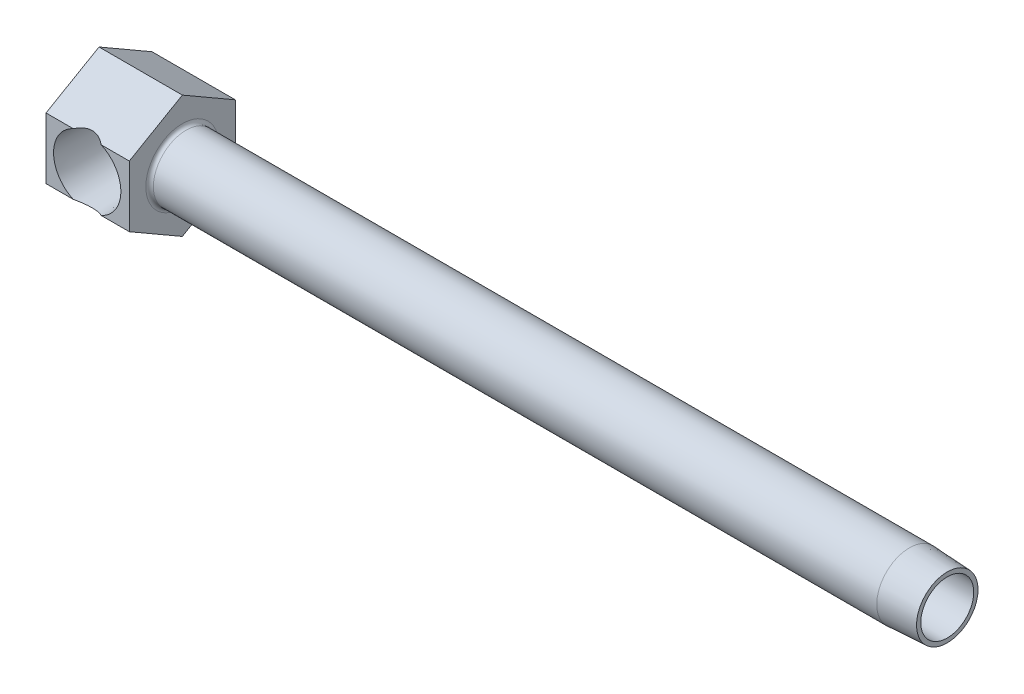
ISO-10303-21;
HEADER;
FILE_DESCRIPTION(('STEP AP214'),'2;1');
FILE_NAME('part.step','',(''),(''),'','','');
FILE_SCHEMA(('AUTOMOTIVE_DESIGN { 1 0 10303 214 1 1 1 1 }'));
ENDSEC;
DATA;
#1=APPLICATION_CONTEXT('core data for automotive mechanical design processes');
#2=APPLICATION_PROTOCOL_DEFINITION('international standard','automotive_design',2000,#1);
#3=PRODUCT_CONTEXT('',#1,'mechanical');
#4=PRODUCT('Part','Part','',(#3));
#5=PRODUCT_RELATED_PRODUCT_CATEGORY('part','',(#4));
#6=PRODUCT_DEFINITION_FORMATION('','',#4);
#7=PRODUCT_DEFINITION_CONTEXT('part definition',#1,'design');
#8=PRODUCT_DEFINITION('design','',#6,#7);
#9=PRODUCT_DEFINITION_SHAPE('','',#8);
#10=(LENGTH_UNIT() NAMED_UNIT(*) SI_UNIT(.MILLI.,.METRE.));
#11=(NAMED_UNIT(*) PLANE_ANGLE_UNIT() SI_UNIT($,.RADIAN.));
#12=(NAMED_UNIT(*) SI_UNIT($,.STERADIAN.) SOLID_ANGLE_UNIT());
#13=UNCERTAINTY_MEASURE_WITH_UNIT(LENGTH_MEASURE(1.E-05),#10,'distance_accuracy_value','');
#14=(GEOMETRIC_REPRESENTATION_CONTEXT(3) GLOBAL_UNCERTAINTY_ASSIGNED_CONTEXT((#13)) GLOBAL_UNIT_ASSIGNED_CONTEXT((#10,
#11,#12)) REPRESENTATION_CONTEXT('',''));
#15=CARTESIAN_POINT('',(0.,0.,0.));
#16=DIRECTION('',(0.,0.,1.));
#17=DIRECTION('',(1.,0.,0.));
#18=AXIS2_PLACEMENT_3D('',#15,#16,#17);
#19=CARTESIAN_POINT('',(63.5,0.,11.1125));
#20=DIRECTION('',(-1.,0.,0.));
#21=DIRECTION('',(0.,0.,1.));
#22=AXIS2_PLACEMENT_3D('',#19,#20,#21);
#23=CYLINDRICAL_SURFACE('',#22,6.858);
#24=CARTESIAN_POINT('',(18.2499,0.,11.1125));
#25=DIRECTION('',(-1.,0.,0.));
#26=DIRECTION('',(0.,-1.,0.));
#27=AXIS2_PLACEMENT_3D('',#24,#25,#26);
#28=CIRCLE('',#27,6.858);
#29=CARTESIAN_POINT('',(18.2499,-6.858,11.1125));
#30=VERTEX_POINT('',#29);
#31=EDGE_CURVE('E174',#30,#30,#28,.F.);
#32=ORIENTED_EDGE('',*,*,#31,.T.);
#33=EDGE_LOOP('',(#32));
#34=FACE_BOUND('',#33,.T.);
#35=CARTESIAN_POINT('',(169.8752,0.,11.1125));
#36=DIRECTION('',(1.,0.,0.));
#37=DIRECTION('',(0.,0.,-1.));
#38=AXIS2_PLACEMENT_3D('',#35,#36,#37);
#39=CIRCLE('',#38,6.858);
#40=CARTESIAN_POINT('',(169.8752,0.,4.2545));
#41=VERTEX_POINT('',#40);
#42=EDGE_CURVE('E218',#41,#41,#39,.T.);
#43=ORIENTED_EDGE('',*,*,#42,.F.);
#44=EDGE_LOOP('',(#43));
#45=FACE_BOUND('',#44,.T.);
#46=ADVANCED_FACE('F15',(#34,#45),#23,.T.);
#47=CARTESIAN_POINT('',(17.4625,6.4158048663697,22.225));
#48=DIRECTION('',(0.,0.,-1.));
#49=DIRECTION('',(0.,1.,0.));
#50=AXIS2_PLACEMENT_3D('',#47,#48,#49);
#51=PLANE('',#50);
#52=CARTESIAN_POINT('',(8.636,0.,22.225));
#53=DIRECTION('',(0.,0.,1.));
#54=DIRECTION('',(1.,0.,0.));
#55=AXIS2_PLACEMENT_3D('',#52,#53,#54);
#56=CIRCLE('',#55,7.05231);
#57=CARTESIAN_POINT('',(5.70811266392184,6.4158048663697,22.225));
#58=VERTEX_POINT('',#57);
#59=CARTESIAN_POINT('',(5.70811266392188,-6.41580486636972,22.225));
#60=VERTEX_POINT('',#59);
#61=EDGE_CURVE('E229',#58,#60,#56,.T.);
#62=ORIENTED_EDGE('',*,*,#61,.F.);
#63=DIRECTION('',(-1.,0.,0.));
#64=VECTOR('',#63,1.);
#65=CARTESIAN_POINT('',(17.4625,6.4158048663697,22.225));
#66=LINE('',#65,#64);
#67=CARTESIAN_POINT('',(0.,6.4158048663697,22.225));
#68=VERTEX_POINT('',#67);
#69=EDGE_CURVE('E158',#58,#68,#66,.T.);
#70=ORIENTED_EDGE('',*,*,#69,.T.);
#71=DIRECTION('',(0.,-1.,0.));
#72=VECTOR('',#71,1.);
#73=CARTESIAN_POINT('',(0.,6.4158048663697,22.225));
#74=LINE('',#73,#72);
#75=CARTESIAN_POINT('',(0.,-6.41580486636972,22.225));
#76=VERTEX_POINT('',#75);
#77=EDGE_CURVE('E128',#68,#76,#74,.T.);
#78=ORIENTED_EDGE('',*,*,#77,.T.);
#79=DIRECTION('',(-1.,0.,0.));
#80=VECTOR('',#79,1.);
#81=CARTESIAN_POINT('',(17.4625,-6.41580486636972,22.225));
#82=LINE('',#81,#80);
#83=EDGE_CURVE('E154',#60,#76,#82,.T.);
#84=ORIENTED_EDGE('',*,*,#83,.F.);
#85=EDGE_LOOP('',(#62,#70,#78,#84));
#86=FACE_BOUND('',#85,.T.);
#87=ADVANCED_FACE('F205',(#86),#51,.F.);
#88=CARTESIAN_POINT('',(11.5638873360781,-6.41580486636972,22.225));
#89=VERTEX_POINT('',#88);
#90=CARTESIAN_POINT('',(11.5638873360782,6.4158048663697,22.225));
#91=VERTEX_POINT('',#90);
#92=EDGE_CURVE('E228',#89,#91,#56,.T.);
#93=ORIENTED_EDGE('',*,*,#92,.F.);
#94=CARTESIAN_POINT('',(17.4625,-6.41580486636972,22.225));
#95=VERTEX_POINT('',#94);
#96=EDGE_CURVE('E155',#95,#89,#82,.T.);
#97=ORIENTED_EDGE('',*,*,#96,.F.);
#98=DIRECTION('',(0.,-1.,0.));
#99=VECTOR('',#98,1.);
#100=CARTESIAN_POINT('',(17.4625,6.4158048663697,22.225));
#101=LINE('',#100,#99);
#102=CARTESIAN_POINT('',(17.4625,6.4158048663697,22.225));
#103=VERTEX_POINT('',#102);
#104=EDGE_CURVE('E145',#103,#95,#101,.T.);
#105=ORIENTED_EDGE('',*,*,#104,.F.);
#106=EDGE_CURVE('E159',#103,#91,#66,.T.);
#107=ORIENTED_EDGE('',*,*,#106,.T.);
#108=EDGE_LOOP('',(#93,#97,#105,#107));
#109=FACE_BOUND('',#108,.T.);
#110=ADVANCED_FACE('F211',(#109),#51,.F.);
#111=CARTESIAN_POINT('',(17.4625,12.8316097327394,11.1125));
#112=DIRECTION('',(0.,-0.866025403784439,-0.5));
#113=DIRECTION('',(0.,0.5,-0.866025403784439));
#114=AXIS2_PLACEMENT_3D('',#111,#112,#113);
#115=PLANE('',#114);
#116=ORIENTED_EDGE('',*,*,#69,.F.);
#117=CARTESIAN_POINT('',(8.636,-0.384020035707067,34.002642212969));
#118=DIRECTION('',(0.,-0.866025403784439,-0.5));
#119=DIRECTION('',(0.,-0.5,0.866025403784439));
#120=AXIS2_PLACEMENT_3D('',#117,#118,#119);
#121=ELLIPSE('',#120,14.8098967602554,7.39498405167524);
#122=EDGE_CURVE('E109',#58,#91,#121,.T.);
#123=ORIENTED_EDGE('',*,*,#122,.T.);
#124=ORIENTED_EDGE('',*,*,#106,.F.);
#125=DIRECTION('',(0.,-0.5,0.866025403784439));
#126=VECTOR('',#125,1.);
#127=CARTESIAN_POINT('',(17.4625,12.8316097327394,11.1125));
#128=LINE('',#127,#126);
#129=CARTESIAN_POINT('',(17.4625,12.8316097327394,11.1125));
#130=VERTEX_POINT('',#129);
#131=EDGE_CURVE('E143',#130,#103,#128,.T.);
#132=ORIENTED_EDGE('',*,*,#131,.F.);
#133=DIRECTION('',(-1.,0.,0.));
#134=VECTOR('',#133,1.);
#135=CARTESIAN_POINT('',(17.4625,12.8316097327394,11.1125));
#136=LINE('',#135,#134);
#137=CARTESIAN_POINT('',(0.,12.8316097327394,11.1125));
#138=VERTEX_POINT('',#137);
#139=EDGE_CURVE('E162',#130,#138,#136,.T.);
#140=ORIENTED_EDGE('',*,*,#139,.T.);
#141=DIRECTION('',(0.,-0.5,0.866025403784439));
#142=VECTOR('',#141,1.);
#143=CARTESIAN_POINT('',(0.,12.8316097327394,11.1125));
#144=LINE('',#143,#142);
#145=EDGE_CURVE('E124',#138,#68,#144,.T.);
#146=ORIENTED_EDGE('',*,*,#145,.T.);
#147=EDGE_LOOP('',(#116,#123,#124,#132,#140,#146));
#148=FACE_BOUND('',#147,.T.);
#149=ADVANCED_FACE('F257',(#148),#115,.F.);
#150=CARTESIAN_POINT('',(17.4625,-6.41580486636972,22.225));
#151=DIRECTION('',(0.,0.866025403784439,-0.5));
#152=DIRECTION('',(0.,0.5,0.866025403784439));
#153=AXIS2_PLACEMENT_3D('',#150,#151,#152);
#154=PLANE('',#153);
#155=ORIENTED_EDGE('',*,*,#96,.T.);
#156=CARTESIAN_POINT('',(8.636,0.384020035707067,34.0026422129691));
#157=DIRECTION('',(0.,0.866025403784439,-0.5));
#158=DIRECTION('',(0.,0.5,0.866025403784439));
#159=AXIS2_PLACEMENT_3D('',#156,#157,#158);
#160=ELLIPSE('',#159,14.8098967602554,7.39498405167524);
#161=EDGE_CURVE('E34',#89,#60,#160,.T.);
#162=ORIENTED_EDGE('',*,*,#161,.T.);
#163=ORIENTED_EDGE('',*,*,#83,.T.);
#164=DIRECTION('',(0.,-0.5,-0.866025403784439));
#165=VECTOR('',#164,1.);
#166=CARTESIAN_POINT('',(0.,-6.41580486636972,22.225));
#167=LINE('',#166,#165);
#168=CARTESIAN_POINT('',(0.,-12.8316097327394,11.1125));
#169=VERTEX_POINT('',#168);
#170=EDGE_CURVE('E132',#76,#169,#167,.T.);
#171=ORIENTED_EDGE('',*,*,#170,.T.);
#172=DIRECTION('',(-1.,0.,0.));
#173=VECTOR('',#172,1.);
#174=CARTESIAN_POINT('',(17.4625,-12.8316097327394,11.1125));
#175=LINE('',#174,#173);
#176=CARTESIAN_POINT('',(17.4625,-12.8316097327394,11.1125));
#177=VERTEX_POINT('',#176);
#178=EDGE_CURVE('E149',#177,#169,#175,.T.);
#179=ORIENTED_EDGE('',*,*,#178,.F.);
#180=DIRECTION('',(0.,-0.5,-0.866025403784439));
#181=VECTOR('',#180,1.);
#182=CARTESIAN_POINT('',(17.4625,-6.41580486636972,22.225));
#183=LINE('',#182,#181);
#184=EDGE_CURVE('E147',#95,#177,#183,.T.);
#185=ORIENTED_EDGE('',*,*,#184,.F.);
#186=EDGE_LOOP('',(#155,#162,#163,#171,#179,#185));
#187=FACE_BOUND('',#186,.T.);
#188=ADVANCED_FACE('F235',(#187),#154,.F.);
#189=CARTESIAN_POINT('',(17.4625,-12.8316097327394,11.1125));
#190=DIRECTION('',(0.,0.866025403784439,0.5));
#191=DIRECTION('',(0.,-0.5,0.866025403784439));
#192=AXIS2_PLACEMENT_3D('',#189,#190,#191);
#193=PLANE('',#192);
#194=DIRECTION('',(0.,0.5,-0.866025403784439));
#195=VECTOR('',#194,1.);
#196=CARTESIAN_POINT('',(0.,-12.8316097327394,11.1125));
#197=LINE('',#196,#195);
#198=CARTESIAN_POINT('',(0.,-6.41580486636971,0.));
#199=VERTEX_POINT('',#198);
#200=EDGE_CURVE('E117',#169,#199,#197,.T.);
#201=ORIENTED_EDGE('',*,*,#200,.T.);
#202=DIRECTION('',(-1.,0.,0.));
#203=VECTOR('',#202,1.);
#204=CARTESIAN_POINT('',(17.4625,-6.41580486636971,0.));
#205=LINE('',#204,#203);
#206=CARTESIAN_POINT('',(17.4625,-6.41580486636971,0.));
#207=VERTEX_POINT('',#206);
#208=EDGE_CURVE('E168',#207,#199,#205,.T.);
#209=ORIENTED_EDGE('',*,*,#208,.F.);
#210=DIRECTION('',(0.,0.5,-0.866025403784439));
#211=VECTOR('',#210,1.);
#212=CARTESIAN_POINT('',(17.4625,-12.8316097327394,11.1125));
#213=LINE('',#212,#211);
#214=EDGE_CURVE('E135',#177,#207,#213,.T.);
#215=ORIENTED_EDGE('',*,*,#214,.F.);
#216=ORIENTED_EDGE('',*,*,#178,.T.);
#217=EDGE_LOOP('',(#201,#209,#215,#216));
#218=FACE_BOUND('',#217,.T.);
#219=ADVANCED_FACE('F247',(#218),#193,.F.);
#220=CARTESIAN_POINT('',(17.4625,-6.41580486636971,0.));
#221=DIRECTION('',(0.,0.,1.));
#222=DIRECTION('',(1.,0.,0.));
#223=AXIS2_PLACEMENT_3D('',#220,#221,#222);
#224=PLANE('',#223);
#225=DIRECTION('',(0.,1.,0.));
#226=VECTOR('',#225,1.);
#227=CARTESIAN_POINT('',(0.,-6.41580486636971,0.));
#228=LINE('',#227,#226);
#229=CARTESIAN_POINT('',(0.,6.41580486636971,0.));
#230=VERTEX_POINT('',#229);
#231=EDGE_CURVE('E118',#199,#230,#228,.T.);
#232=ORIENTED_EDGE('',*,*,#231,.T.);
#233=DIRECTION('',(-1.,0.,0.));
#234=VECTOR('',#233,1.);
#235=CARTESIAN_POINT('',(17.4625,6.41580486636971,0.));
#236=LINE('',#235,#234);
#237=CARTESIAN_POINT('',(17.4625,6.41580486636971,0.));
#238=VERTEX_POINT('',#237);
#239=EDGE_CURVE('E165',#238,#230,#236,.T.);
#240=ORIENTED_EDGE('',*,*,#239,.F.);
#241=DIRECTION('',(0.,1.,0.));
#242=VECTOR('',#241,1.);
#243=CARTESIAN_POINT('',(17.4625,-6.41580486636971,0.));
#244=LINE('',#243,#242);
#245=EDGE_CURVE('E139',#207,#238,#244,.T.);
#246=ORIENTED_EDGE('',*,*,#245,.F.);
#247=ORIENTED_EDGE('',*,*,#208,.T.);
#248=EDGE_LOOP('',(#232,#240,#246,#247));
#249=FACE_BOUND('',#248,.T.);
#250=ADVANCED_FACE('F264',(#249),#224,.F.);
#251=CARTESIAN_POINT('',(17.4625,6.4158048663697,0.));
#252=DIRECTION('',(0.,-0.866025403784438,0.5));
#253=DIRECTION('',(0.,-0.5,-0.866025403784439));
#254=AXIS2_PLACEMENT_3D('',#251,#252,#253);
#255=PLANE('',#254);
#256=DIRECTION('',(0.,0.5,0.866025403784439));
#257=VECTOR('',#256,1.);
#258=CARTESIAN_POINT('',(0.,6.4158048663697,0.));
#259=LINE('',#258,#257);
#260=EDGE_CURVE('E121',#230,#138,#259,.T.);
#261=ORIENTED_EDGE('',*,*,#260,.T.);
#262=ORIENTED_EDGE('',*,*,#139,.F.);
#263=DIRECTION('',(0.,0.5,0.866025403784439));
#264=VECTOR('',#263,1.);
#265=CARTESIAN_POINT('',(17.4625,6.4158048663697,0.));
#266=LINE('',#265,#264);
#267=EDGE_CURVE('E141',#238,#130,#266,.T.);
#268=ORIENTED_EDGE('',*,*,#267,.F.);
#269=ORIENTED_EDGE('',*,*,#239,.T.);
#270=EDGE_LOOP('',(#261,#262,#268,#269));
#271=FACE_BOUND('',#270,.T.);
#272=ADVANCED_FACE('F261',(#271),#255,.F.);
#273=CARTESIAN_POINT('',(17.4625,-19.2474145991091,22.225));
#274=DIRECTION('',(-1.,0.,0.));
#275=DIRECTION('',(0.,-1.,0.));
#276=AXIS2_PLACEMENT_3D('',#273,#274,#275);
#277=PLANE('',#276);
#278=CARTESIAN_POINT('',(17.4625,0.,11.1125));
#279=DIRECTION('',(-1.,0.,0.));
#280=DIRECTION('',(0.,-1.,0.));
#281=AXIS2_PLACEMENT_3D('',#278,#279,#280);
#282=CIRCLE('',#281,7.6454);
#283=CARTESIAN_POINT('',(17.4625,-7.6454,11.1125));
#284=VERTEX_POINT('',#283);
#285=EDGE_CURVE('E171',#284,#284,#282,.T.);
#286=ORIENTED_EDGE('',*,*,#285,.T.);
#287=EDGE_LOOP('',(#286));
#288=FACE_BOUND('',#287,.T.);
#289=ORIENTED_EDGE('',*,*,#214,.T.);
#290=ORIENTED_EDGE('',*,*,#245,.T.);
#291=ORIENTED_EDGE('',*,*,#267,.T.);
#292=ORIENTED_EDGE('',*,*,#131,.T.);
#293=ORIENTED_EDGE('',*,*,#104,.T.);
#294=ORIENTED_EDGE('',*,*,#184,.T.);
#295=EDGE_LOOP('',(#289,#290,#291,#292,#293,#294));
#296=FACE_BOUND('',#295,.T.);
#297=ADVANCED_FACE('F250',(#288,#296),#277,.F.);
#298=CARTESIAN_POINT('',(0.,-19.2474145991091,22.225));
#299=DIRECTION('',(-1.,0.,0.));
#300=DIRECTION('',(0.,-1.,0.));
#301=AXIS2_PLACEMENT_3D('',#298,#299,#300);
#302=PLANE('',#301);
#303=ORIENTED_EDGE('',*,*,#200,.F.);
#304=ORIENTED_EDGE('',*,*,#170,.F.);
#305=ORIENTED_EDGE('',*,*,#77,.F.);
#306=ORIENTED_EDGE('',*,*,#145,.F.);
#307=ORIENTED_EDGE('',*,*,#260,.F.);
#308=ORIENTED_EDGE('',*,*,#231,.F.);
#309=EDGE_LOOP('',(#303,#304,#305,#306,#307,#308));
#310=FACE_BOUND('',#309,.T.);
#311=ADVANCED_FACE('F243',(#310),#302,.T.);
#312=CARTESIAN_POINT('',(18.2499,0.,11.1125));
#313=DIRECTION('',(-1.,0.,0.));
#314=DIRECTION('',(0.,-1.,0.));
#315=AXIS2_PLACEMENT_3D('',#312,#313,#314);
#316=TOROIDAL_SURFACE('',#315,7.6454,0.7874);
#317=ORIENTED_EDGE('',*,*,#31,.F.);
#318=EDGE_LOOP('',(#317));
#319=FACE_BOUND('',#318,.T.);
#320=ORIENTED_EDGE('',*,*,#285,.F.);
#321=EDGE_LOOP('',(#320));
#322=FACE_BOUND('',#321,.T.);
#323=ADVANCED_FACE('F282',(#319,#322),#316,.F.);
#324=CARTESIAN_POINT('',(63.5,0.,11.1125));
#325=DIRECTION('',(1.,0.,0.));
#326=DIRECTION('',(0.,0.,-1.));
#327=AXIS2_PLACEMENT_3D('',#324,#325,#326);
#328=CYLINDRICAL_SURFACE('',#327,5.5499);
#329=DIRECTION('',(1.,0.,0.));
#330=VECTOR('',#329,1.);
#331=CARTESIAN_POINT('',(63.5,1.29165930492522,5.715));
#332=LINE('',#331,#330);
#333=CARTESIAN_POINT('',(15.0655177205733,1.29165930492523,5.715));
#334=VERTEX_POINT('',#333);
#335=CARTESIAN_POINT('',(14.0465577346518,1.29165930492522,5.715));
#336=VERTEX_POINT('',#335);
#337=EDGE_CURVE('E27',#334,#336,#332,.F.);
#338=ORIENTED_EDGE('',*,*,#337,.T.);
#339=CARTESIAN_POINT('',(14.0465577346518,1.29165930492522,5.715));
#340=CARTESIAN_POINT('',(14.0725617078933,1.1828202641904,5.68893317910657));
#341=CARTESIAN_POINT('',(14.0954190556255,1.0724477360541,5.66602138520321));
#342=CARTESIAN_POINT('',(14.1345363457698,0.849345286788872,5.62681178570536));
#343=CARTESIAN_POINT('',(14.1507939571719,0.736614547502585,5.61051631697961));
#344=CARTESIAN_POINT('',(14.1760383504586,0.512691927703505,5.58521342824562));
#345=CARTESIAN_POINT('',(14.1852120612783,0.401542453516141,5.57601863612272));
#346=CARTESIAN_POINT('',(14.1968530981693,0.17856718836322,5.56435088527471));
#347=CARTESIAN_POINT('',(14.1993222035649,0.0667415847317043,5.56187614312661));
#348=CARTESIAN_POINT('',(14.1975723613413,-0.14949882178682,5.56362999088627));
#349=CARTESIAN_POINT('',(14.193779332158,-0.253921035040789,5.56743168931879));
#350=CARTESIAN_POINT('',(14.1803598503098,-0.462026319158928,5.58088200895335));
#351=CARTESIAN_POINT('',(14.1707325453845,-0.565709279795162,5.59053148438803));
#352=CARTESIAN_POINT('',(14.1454600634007,-0.774399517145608,5.61586264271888));
#353=CARTESIAN_POINT('',(14.12966315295,-0.87936981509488,5.63169642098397));
#354=CARTESIAN_POINT('',(14.092340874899,-1.08722287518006,5.6691068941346));
#355=CARTESIAN_POINT('',(14.0708169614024,-1.1901061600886,5.69068213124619));
#356=CARTESIAN_POINT('',(14.0465577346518,-1.29165930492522,5.715));
#357=B_SPLINE_CURVE_WITH_KNOTS('',3,(#339,#340,#341,#342,#343,#344,#345,#346,#347,#348,#349,
#350,#351,#352,#353,#354,#355,#356),.UNSPECIFIED.,.F.,.F.,(4,2,2,2,2,2,2,2,4),(0.,
0.344637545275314,0.689396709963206,1.02471413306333,1.35994255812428,1.67329546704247,
1.98669416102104,2.30834220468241,2.62990865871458),.UNSPECIFIED.);
#358=CARTESIAN_POINT('',(14.0465577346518,-1.29165930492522,5.715));
#359=VERTEX_POINT('',#358);
#360=EDGE_CURVE('E10',#336,#359,#357,.T.);
#361=ORIENTED_EDGE('',*,*,#360,.T.);
#362=DIRECTION('',(1.,0.,0.));
#363=VECTOR('',#362,1.);
#364=CARTESIAN_POINT('',(63.5,-1.29165930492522,5.715));
#365=LINE('',#364,#363);
#366=CARTESIAN_POINT('',(15.0655177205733,-1.29165930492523,5.715));
#367=VERTEX_POINT('',#366);
#368=EDGE_CURVE('E184',#359,#367,#365,.T.);
#369=ORIENTED_EDGE('',*,*,#368,.T.);
#370=CARTESIAN_POINT('',(15.0656795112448,-1.29082327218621,5.71480000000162));
#371=CARTESIAN_POINT('',(15.0372536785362,-1.43791824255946,5.7499521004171));
#372=CARTESIAN_POINT('',(15.0041876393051,-1.58262926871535,5.79093746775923));
#373=CARTESIAN_POINT('',(14.9298152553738,-1.86616189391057,5.88364074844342));
#374=CARTESIAN_POINT('',(14.8885204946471,-2.00499144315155,5.93534357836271));
#375=CARTESIAN_POINT('',(14.7990709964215,-2.27477346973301,6.0481148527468));
#376=CARTESIAN_POINT('',(14.7509848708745,-2.40578805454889,6.10909004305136));
#377=CARTESIAN_POINT('',(14.6486806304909,-2.66083130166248,6.2399326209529));
#378=CARTESIAN_POINT('',(14.5944604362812,-2.78485757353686,6.30980302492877));
#379=CARTESIAN_POINT('',(14.4812536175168,-3.02482355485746,6.4572285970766));
#380=CARTESIAN_POINT('',(14.4222960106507,-3.1408054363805,6.53473755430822));
#381=CARTESIAN_POINT('',(14.3003856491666,-3.365215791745,6.6970845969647));
#382=CARTESIAN_POINT('',(14.2374332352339,-3.47364490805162,6.78192205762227));
#383=CARTESIAN_POINT('',(14.0435453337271,-3.78827180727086,7.04729631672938));
#384=CARTESIAN_POINT('',(13.9079456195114,-3.9830565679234,7.23822682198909));
#385=CARTESIAN_POINT('',(13.689310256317,-4.26816238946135,7.56146618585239));
#386=CARTESIAN_POINT('',(13.6074310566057,-4.3686517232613,7.68585924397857));
#387=CARTESIAN_POINT('',(13.4442899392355,-4.55879004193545,7.94320688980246));
#388=CARTESIAN_POINT('',(13.3630282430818,-4.6484352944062,8.07616440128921));
#389=CARTESIAN_POINT('',(13.2036424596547,-4.81645966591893,8.35044586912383));
#390=CARTESIAN_POINT('',(13.1255135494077,-4.89485662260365,8.49175606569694));
#391=CARTESIAN_POINT('',(12.9752684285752,-5.04004510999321,8.78316437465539));
#392=CARTESIAN_POINT('',(12.9031480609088,-5.10684469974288,8.93325628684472));
#393=CARTESIAN_POINT('',(12.757824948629,-5.23785122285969,9.26762207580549));
#394=CARTESIAN_POINT('',(12.686320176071,-5.29990617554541,9.45350692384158));
#395=CARTESIAN_POINT('',(12.5645322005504,-5.40502712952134,9.83721903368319));
#396=CARTESIAN_POINT('',(12.5142004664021,-5.44813656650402,10.035017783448));
#397=CARTESIAN_POINT('',(12.4606756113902,-5.49679755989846,10.3395644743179));
#398=CARTESIAN_POINT('',(12.4464754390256,-5.51038902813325,10.443158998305));
#399=CARTESIAN_POINT('',(12.4264834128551,-5.5317354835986,10.6517762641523));
#400=CARTESIAN_POINT('',(12.4206908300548,-5.53949097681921,10.7567988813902));
#401=CARTESIAN_POINT('',(12.4179376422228,-5.54899639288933,10.9671942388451));
#402=CARTESIAN_POINT('',(12.4209736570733,-5.55074861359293,11.0725668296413));
#403=CARTESIAN_POINT('',(12.4357182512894,-5.54828805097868,11.2826067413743));
#404=CARTESIAN_POINT('',(12.4474268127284,-5.54407527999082,11.3872740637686));
#405=CARTESIAN_POINT('',(12.4900727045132,-5.52483789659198,11.6684350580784));
#406=CARTESIAN_POINT('',(12.5287513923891,-5.5042766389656,11.8434168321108));
#407=CARTESIAN_POINT('',(12.6245766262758,-5.44793106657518,12.1856637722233));
#408=CARTESIAN_POINT('',(12.6817493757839,-5.41212512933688,12.3529176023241));
#409=CARTESIAN_POINT('',(12.8020710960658,-5.33165221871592,12.6608364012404));
#410=CARTESIAN_POINT('',(12.8638814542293,-5.28838367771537,12.8024081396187));
#411=CARTESIAN_POINT('',(12.9946271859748,-5.19196308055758,13.0788046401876));
#412=CARTESIAN_POINT('',(13.0635675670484,-5.13880405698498,13.2136245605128));
#413=CARTESIAN_POINT('',(13.2061680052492,-5.0230773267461,13.476991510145));
#414=CARTESIAN_POINT('',(13.2798387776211,-4.96048779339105,13.6055230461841));
#415=CARTESIAN_POINT('',(13.4297455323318,-4.82635797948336,13.8561944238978));
#416=CARTESIAN_POINT('',(13.505980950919,-4.75481965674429,13.9783356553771));
#417=CARTESIAN_POINT('',(13.664111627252,-4.59832635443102,14.2236446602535));
#418=CARTESIAN_POINT('',(13.7460684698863,-4.51281916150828,14.3464205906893));
#419=CARTESIAN_POINT('',(13.9094765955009,-4.33199713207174,14.5849036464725));
#420=CARTESIAN_POINT('',(13.9909278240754,-4.23668125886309,14.7006100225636));
#421=CARTESIAN_POINT('',(14.1517819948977,-4.03638256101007,14.9245234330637));
#422=CARTESIAN_POINT('',(14.231187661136,-3.93141354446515,15.0327408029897));
#423=CARTESIAN_POINT('',(14.3867175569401,-3.71172769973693,15.2413555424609));
#424=CARTESIAN_POINT('',(14.4628409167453,-3.59700831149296,15.3417508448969));
#425=CARTESIAN_POINT('',(14.668135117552,-3.26437402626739,15.6091426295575));
#426=CARTESIAN_POINT('',(14.7924014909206,-3.03572507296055,15.7670513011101));
#427=CARTESIAN_POINT('',(14.961823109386,-2.67104021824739,15.9794040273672));
#428=CARTESIAN_POINT('',(15.0154673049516,-2.54586009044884,16.0461031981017));
#429=CARTESIAN_POINT('',(15.1161712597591,-2.28856209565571,16.1705894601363));
#430=CARTESIAN_POINT('',(15.1632322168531,-2.15644549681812,16.2283781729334));
#431=CARTESIAN_POINT('',(15.2428146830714,-1.9076542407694,16.3256678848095));
#432=CARTESIAN_POINT('',(15.2764575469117,-1.79190088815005,16.3666154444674));
#433=CARTESIAN_POINT('',(15.3378292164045,-1.55651069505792,16.4410921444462));
#434=CARTESIAN_POINT('',(15.3655591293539,-1.43687458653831,16.4746226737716));
#435=CARTESIAN_POINT('',(15.4145953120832,-1.19439983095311,16.5337884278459));
#436=CARTESIAN_POINT('',(15.4359031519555,-1.0715619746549,16.5594255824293));
#437=CARTESIAN_POINT('',(15.4716760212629,-0.823504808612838,16.6024058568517));
#438=CARTESIAN_POINT('',(15.4861437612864,-0.698286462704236,16.6197522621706));
#439=CARTESIAN_POINT('',(15.5079865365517,-0.445852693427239,16.645922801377));
#440=CARTESIAN_POINT('',(15.5153340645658,-0.318631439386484,16.6547138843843));
#441=CARTESIAN_POINT('',(15.522677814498,-0.063671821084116,16.6635004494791));
#442=CARTESIAN_POINT('',(15.5226740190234,0.0640665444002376,16.6634959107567));
#443=CARTESIAN_POINT('',(15.5153149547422,0.319031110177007,16.6546910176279));
#444=CARTESIAN_POINT('',(15.5079593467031,0.446257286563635,16.64589025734));
#445=CARTESIAN_POINT('',(15.4860583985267,0.699182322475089,16.6196499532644));
#446=CARTESIAN_POINT('',(15.4715132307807,0.824881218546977,16.6022106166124));
#447=CARTESIAN_POINT('',(15.4365532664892,1.06681669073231,16.5602063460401));
#448=CARTESIAN_POINT('',(15.4165150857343,1.18318753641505,16.5360979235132));
#449=CARTESIAN_POINT('',(15.370668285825,1.41308832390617,16.4807930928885));
#450=CARTESIAN_POINT('',(15.3448577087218,1.52661728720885,16.4495942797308));
#451=CARTESIAN_POINT('',(15.2593968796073,1.8619852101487,16.3459550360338));
#452=CARTESIAN_POINT('',(15.1916934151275,2.07876635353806,16.2634431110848));
#453=CARTESIAN_POINT('',(15.0313088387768,2.51543897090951,16.0659794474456));
#454=CARTESIAN_POINT('',(14.9368359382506,2.73357267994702,15.9486491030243));
#455=CARTESIAN_POINT('',(14.7321201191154,3.14711164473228,15.6903358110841));
#456=CARTESIAN_POINT('',(14.6218705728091,3.34250728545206,15.549342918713));
#457=CARTESIAN_POINT('',(14.3660176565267,3.74896640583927,15.2149275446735));
#458=CARTESIAN_POINT('',(14.217881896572,3.95452519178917,15.0167316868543));
#459=CARTESIAN_POINT('',(13.9905991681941,4.23685264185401,14.7000501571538));
#460=CARTESIAN_POINT('',(13.9138995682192,4.32671599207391,14.5911203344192));
#461=CARTESIAN_POINT('',(13.7600052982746,4.49774000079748,14.366972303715));
#462=CARTESIAN_POINT('',(13.682810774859,4.57890311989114,14.2517558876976));
#463=CARTESIAN_POINT('',(13.5283146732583,4.73340315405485,14.0136509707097));
#464=CARTESIAN_POINT('',(13.4510233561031,4.80663208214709,13.8906858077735));
#465=CARTESIAN_POINT('',(13.2989020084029,4.94395744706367,13.6382338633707));
#466=CARTESIAN_POINT('',(13.2240725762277,5.00805167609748,13.5087455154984));
#467=CARTESIAN_POINT('',(13.0790371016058,5.12664196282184,13.2432341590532));
#468=CARTESIAN_POINT('',(13.0088235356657,5.18115389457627,13.107222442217));
#469=CARTESIAN_POINT('',(12.8755190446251,5.28008101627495,12.8283198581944));
#470=CARTESIAN_POINT('',(12.8124234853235,5.3245027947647,12.6854335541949));
#471=CARTESIAN_POINT('',(12.6833891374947,5.4112685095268,12.3591277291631));
#472=CARTESIAN_POINT('',(12.6200540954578,5.45085356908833,12.1738679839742));
#473=CARTESIAN_POINT('',(12.5423523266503,5.49611259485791,11.8892630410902));
#474=CARTESIAN_POINT('',(12.5193453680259,5.50884182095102,11.7933456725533));
#475=CARTESIAN_POINT('',(12.4799604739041,5.52933440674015,11.5996550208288));
#476=CARTESIAN_POINT('',(12.4635791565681,5.53710030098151,11.5018827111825));
#477=CARTESIAN_POINT('',(12.4380468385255,5.54748556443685,11.3040796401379));
#478=CARTESIAN_POINT('',(12.4289726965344,5.55005064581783,11.2040359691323));
#479=CARTESIAN_POINT('',(12.418786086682,5.54973569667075,11.0035516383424));
#480=CARTESIAN_POINT('',(12.4176731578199,5.54685598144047,10.9031110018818));
#481=CARTESIAN_POINT('',(12.4234254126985,5.53566138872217,10.7027211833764));
#482=CARTESIAN_POINT('',(12.4302942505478,5.52734402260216,10.6027722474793));
#483=CARTESIAN_POINT('',(12.4515981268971,5.5054275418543,10.4042328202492));
#484=CARTESIAN_POINT('',(12.4660373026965,5.4918255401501,10.3056431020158));
#485=CARTESIAN_POINT('',(12.5044721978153,5.45712893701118,10.0955734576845));
#486=CARTESIAN_POINT('',(12.5295946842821,5.43520467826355,9.98443807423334));
#487=CARTESIAN_POINT('',(12.5874763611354,5.38514310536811,9.76556012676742));
#488=CARTESIAN_POINT('',(12.6202414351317,5.35700100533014,9.65782024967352));
#489=CARTESIAN_POINT('',(12.6919869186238,5.29489520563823,9.44585515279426));
#490=CARTESIAN_POINT('',(12.7309829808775,5.2609168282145,9.34163960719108));
#491=CARTESIAN_POINT('',(12.813732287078,5.18758941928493,9.13712531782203));
#492=CARTESIAN_POINT('',(12.8574843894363,5.14824167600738,9.03682564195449));
#493=CARTESIAN_POINT('',(12.9739768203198,5.04107082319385,8.78510193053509));
#494=CARTESIAN_POINT('',(13.0492646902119,4.96961386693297,8.63639571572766));
#495=CARTESIAN_POINT('',(13.2048344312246,4.81508369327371,8.34787401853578));
#496=CARTESIAN_POINT('',(13.2851189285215,4.73200433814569,8.20806329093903));
#497=CARTESIAN_POINT('',(13.4480056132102,4.55446924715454,7.93688996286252));
#498=CARTESIAN_POINT('',(13.5306114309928,4.45999483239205,7.80554179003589));
#499=CARTESIAN_POINT('',(13.6957298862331,4.25996324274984,7.55156980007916));
#500=CARTESIAN_POINT('',(13.7782425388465,4.15440825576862,7.42894426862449));
#501=CARTESIAN_POINT('',(13.9441031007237,3.92836612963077,7.18853642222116));
#502=CARTESIAN_POINT('',(14.0273794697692,3.80748613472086,7.0710730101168));
#503=CARTESIAN_POINT('',(14.1898135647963,3.55392137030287,6.84638586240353));
#504=CARTESIAN_POINT('',(14.2689704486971,3.42123420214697,6.73916421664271));
#505=CARTESIAN_POINT('',(14.420885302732,3.14485348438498,6.53641941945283));
#506=CARTESIAN_POINT('',(14.4936705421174,3.0012123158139,6.44084565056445));
#507=CARTESIAN_POINT('',(14.6312840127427,2.70291662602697,6.2621549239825));
#508=CARTESIAN_POINT('',(14.6961173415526,2.54826926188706,6.17902997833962));
#509=CARTESIAN_POINT('',(14.8204425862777,2.21665612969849,6.02094073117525));
#510=CARTESIAN_POINT('',(14.8791782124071,2.03888590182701,5.94704372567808));
#511=CARTESIAN_POINT('',(14.957111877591,1.76426185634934,5.84958505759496));
#512=CARTESIAN_POINT('',(14.9814347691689,1.67119024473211,5.81928093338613));
#513=CARTESIAN_POINT('',(15.0263924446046,1.48269404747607,5.76341790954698));
#514=CARTESIAN_POINT('',(15.047024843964,1.38726798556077,5.73786207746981));
#515=CARTESIAN_POINT('',(15.0656795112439,1.2908232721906,5.71480000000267));
#516=B_SPLINE_CURVE_WITH_KNOTS('',3,(#370,#371,#372,#373,#374,#375,#376,#377,#378,#379,#380,
#381,#382,#383,#384,#385,#386,#387,#388,#389,#390,#391,#392,#393,#394,#395,#396,#397,#398,#399,
#400,#401,#402,#403,#404,#405,#406,#407,#408,#409,#410,#411,#412,#413,#414,#415,#416,#417,#418,
#419,#420,#421,#422,#423,#424,#425,#426,#427,#428,#429,#430,#431,#432,#433,#434,#435,#436,#437,
#438,#439,#440,#441,#442,#443,#444,#445,#446,#447,#448,#449,#450,#451,#452,#453,#454,#455,#456,
#457,#458,#459,#460,#461,#462,#463,#464,#465,#466,#467,#468,#469,#470,#471,#472,#473,#474,#475,
#476,#477,#478,#479,#480,#481,#482,#483,#484,#485,#486,#487,#488,#489,#490,#491,#492,#493,#494,
#495,#496,#497,#498,#499,#500,#501,#502,#503,#504,#505,#506,#507,#508,#509,#510,#511,#512,#513,
#514,#515),.UNSPECIFIED.,.F.,.F.,(4,2,2,2,2,2,2,2,2,2,2,2,2,2,2,2,2,2,2,2,2,2,2,2,2,2,2,2,2,2,2,
2,2,2,2,2,2,2,2,2,2,2,2,2,2,2,2,2,2,2,2,2,2,2,2,2,2,2,2,2,2,2,2,2,2,2,2,2,2,2,2,2,4),(0.,
0.461329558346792,0.922014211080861,1.37833951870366,1.83481998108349,2.2886910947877,
2.74252355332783,3.65304009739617,4.19159436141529,4.73033346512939,5.26820855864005,
5.80570837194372,6.42981366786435,7.05248053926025,7.36837231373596,7.68423669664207,
7.99998016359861,8.31572297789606,8.85459341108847,9.39423071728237,9.87481564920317,
10.3557404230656,10.837795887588,11.3197460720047,11.8310943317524,12.3424966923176,
12.8531785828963,13.3639949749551,14.2729996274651,14.7275015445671,15.1819206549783,
15.5634665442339,15.9449409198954,16.3263219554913,16.707551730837,17.0902484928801,
17.472946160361,17.8556614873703,18.2383676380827,18.5995247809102,18.9608046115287,
19.682873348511,20.4753483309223,21.2681572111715,22.2295647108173,22.7113905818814,
23.1930798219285,23.6806666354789,24.1683710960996,24.6552598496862,25.1418297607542,
25.7388115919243,26.0368814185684,26.3347989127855,26.6358104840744,26.9368046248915,
27.237936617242,27.5392333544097,27.8867825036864,28.2346001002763,28.5833055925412,
28.9319275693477,29.4751694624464,30.0186993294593,30.5631325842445,31.1074585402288,
31.6708023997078,32.2342609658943,32.7951763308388,33.3557302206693,33.9579898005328,
34.2603814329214,34.5629677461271),.UNSPECIFIED.);
#517=EDGE_CURVE('E177',#367,#334,#516,.T.);
#518=ORIENTED_EDGE('',*,*,#517,.T.);
#519=EDGE_LOOP('',(#338,#361,#369,#518));
#520=FACE_BOUND('',#519,.T.);
#521=CARTESIAN_POINT('',(177.8,0.,11.1125));
#522=DIRECTION('',(1.,0.,0.));
#523=DIRECTION('',(0.,0.,-1.));
#524=AXIS2_PLACEMENT_3D('',#521,#522,#523);
#525=CIRCLE('',#524,5.5499);
#526=CARTESIAN_POINT('',(177.8,0.,5.5626));
#527=VERTEX_POINT('',#526);
#528=EDGE_CURVE('E223',#527,#527,#525,.T.);
#529=ORIENTED_EDGE('',*,*,#528,.T.);
#530=EDGE_LOOP('',(#529));
#531=FACE_BOUND('',#530,.T.);
#532=ADVANCED_FACE('F185',(#520,#531),#328,.F.);
#533=CARTESIAN_POINT('',(14.1986,0.,5.715));
#534=DIRECTION('',(0.,0.,-1.));
#535=DIRECTION('',(-1.,0.,0.));
#536=AXIS2_PLACEMENT_3D('',#533,#534,#535);
#537=PLANE('',#536);
#538=CARTESIAN_POINT('',(8.636,0.,5.715));
#539=DIRECTION('',(0.,0.,1.));
#540=DIRECTION('',(1.,0.,0.));
#541=AXIS2_PLACEMENT_3D('',#538,#539,#540);
#542=CIRCLE('',#541,6.55797849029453);
#543=EDGE_CURVE('E41',#334,#367,#542,.T.);
#544=ORIENTED_EDGE('',*,*,#543,.T.);
#545=ORIENTED_EDGE('',*,*,#368,.F.);
#546=CARTESIAN_POINT('',(8.636,0.,5.715));
#547=DIRECTION('',(0.,0.,1.));
#548=DIRECTION('',(1.,0.,0.));
#549=AXIS2_PLACEMENT_3D('',#546,#547,#548);
#550=CIRCLE('',#549,5.5626);
#551=EDGE_CURVE('E107',#336,#359,#550,.T.);
#552=ORIENTED_EDGE('',*,*,#551,.F.);
#553=ORIENTED_EDGE('',*,*,#337,.F.);
#554=EDGE_LOOP('',(#544,#545,#552,#553));
#555=FACE_BOUND('',#554,.T.);
#556=ADVANCED_FACE('F194',(#555),#537,.F.);
#557=CARTESIAN_POINT('',(8.636,0.,22.225));
#558=DIRECTION('',(0.,0.,1.));
#559=DIRECTION('',(1.,0.,0.));
#560=AXIS2_PLACEMENT_3D('',#557,#558,#559);
#561=CYLINDRICAL_SURFACE('',#560,5.5626);
#562=CARTESIAN_POINT('',(8.636,0.,4.445));
#563=DIRECTION('',(0.,0.,1.));
#564=DIRECTION('',(1.,0.,0.));
#565=AXIS2_PLACEMENT_3D('',#562,#563,#564);
#566=CIRCLE('',#565,5.5626);
#567=CARTESIAN_POINT('',(14.1986,0.,4.445));
#568=VERTEX_POINT('',#567);
#569=EDGE_CURVE('E105',#568,#568,#566,.T.);
#570=ORIENTED_EDGE('',*,*,#569,.F.);
#571=EDGE_LOOP('',(#570));
#572=FACE_BOUND('',#571,.T.);
#573=ORIENTED_EDGE('',*,*,#551,.T.);
#574=ORIENTED_EDGE('',*,*,#360,.F.);
#575=EDGE_LOOP('',(#573,#574));
#576=FACE_BOUND('',#575,.T.);
#577=ADVANCED_FACE('F192',(#572,#576),#561,.F.);
#578=CARTESIAN_POINT('',(8.636,0.,22.225));
#579=DIRECTION('',(0.,0.,1.));
#580=DIRECTION('',(1.,0.,0.));
#581=AXIS2_PLACEMENT_3D('',#578,#579,#580);
#582=CONICAL_SURFACE('',#581,7.05231,0.0299323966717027);
#583=ORIENTED_EDGE('',*,*,#543,.F.);
#584=ORIENTED_EDGE('',*,*,#517,.F.);
#585=EDGE_LOOP('',(#583,#584));
#586=FACE_BOUND('',#585,.T.);
#587=ORIENTED_EDGE('',*,*,#61,.T.);
#588=ORIENTED_EDGE('',*,*,#161,.F.);
#589=ORIENTED_EDGE('',*,*,#92,.T.);
#590=ORIENTED_EDGE('',*,*,#122,.F.);
#591=EDGE_LOOP('',(#587,#588,#589,#590));
#592=FACE_BOUND('',#591,.T.);
#593=ADVANCED_FACE('F101',(#586,#592),#582,.F.);
#594=CARTESIAN_POINT('',(8.636,0.,4.445));
#595=DIRECTION('',(0.,0.,1.));
#596=DIRECTION('',(1.,0.,0.));
#597=AXIS2_PLACEMENT_3D('',#594,#595,#596);
#598=CONICAL_SURFACE('',#597,5.5626,1.02974425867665);
#599=CARTESIAN_POINT('',(8.636,0.,1.10265272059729));
#600=VERTEX_POINT('',#599);
#601=VERTEX_LOOP('',#600);
#602=FACE_BOUND('',#601,.T.);
#603=ORIENTED_EDGE('',*,*,#569,.T.);
#604=EDGE_LOOP('',(#603));
#605=FACE_BOUND('',#604,.T.);
#606=ADVANCED_FACE('F97',(#602,#605),#598,.F.);
#607=CARTESIAN_POINT('',(177.8,0.,5.5626));
#608=DIRECTION('',(1.,0.,0.));
#609=DIRECTION('',(0.,0.,-1.));
#610=AXIS2_PLACEMENT_3D('',#607,#608,#609);
#611=PLANE('',#610);
#612=CARTESIAN_POINT('',(177.8,0.,11.1125));
#613=DIRECTION('',(1.,0.,0.));
#614=DIRECTION('',(0.,0.,-1.));
#615=AXIS2_PLACEMENT_3D('',#612,#613,#614);
#616=CIRCLE('',#615,6.44267883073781);
#617=CARTESIAN_POINT('',(177.8,0.,4.66982116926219));
#618=VERTEX_POINT('',#617);
#619=EDGE_CURVE('E220',#618,#618,#616,.T.);
#620=ORIENTED_EDGE('',*,*,#619,.T.);
#621=EDGE_LOOP('',(#620));
#622=FACE_BOUND('',#621,.T.);
#623=ORIENTED_EDGE('',*,*,#528,.F.);
#624=EDGE_LOOP('',(#623));
#625=FACE_BOUND('',#624,.T.);
#626=ADVANCED_FACE('F100',(#622,#625),#611,.T.);
#627=CARTESIAN_POINT('',(177.8,0.,11.1125));
#628=DIRECTION('',(-1.,0.,0.));
#629=DIRECTION('',(0.,0.,1.));
#630=AXIS2_PLACEMENT_3D('',#627,#628,#629);
#631=CONICAL_SURFACE('',#630,6.44267883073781,0.052359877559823);
#632=ORIENTED_EDGE('',*,*,#42,.T.);
#633=EDGE_LOOP('',(#632));
#634=FACE_BOUND('',#633,.T.);
#635=ORIENTED_EDGE('',*,*,#619,.F.);
#636=EDGE_LOOP('',(#635));
#637=FACE_BOUND('',#636,.T.);
#638=ADVANCED_FACE('F300',(#634,#637),#631,.T.);
#639=CLOSED_SHELL('',(#46,#87,#110,#149,#188,#219,#250,#272,#297,#311,#323,#532,#556,#577,#593,
#606,#626,#638));
#640=MANIFOLD_SOLID_BREP('B1',#639);
#641=ADVANCED_BREP_SHAPE_REPRESENTATION('',(#18,#640),#14);
#642=SHAPE_DEFINITION_REPRESENTATION(#9,#641);
ENDSEC;
END-ISO-10303-21;
